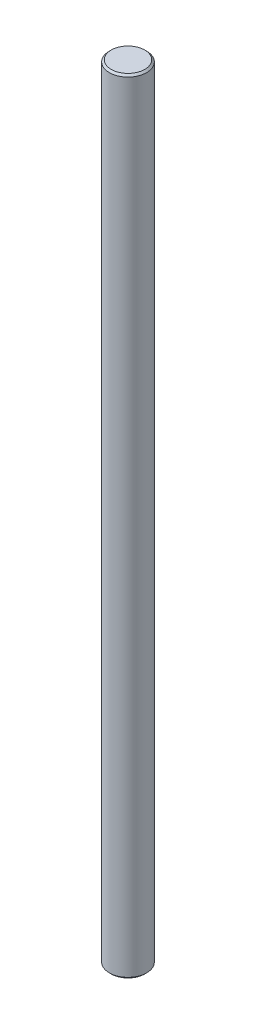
ISO-10303-21;
HEADER;
FILE_DESCRIPTION(('STEP AP214'),'2;1');
FILE_NAME('part.step','',(''),(''),'','','');
FILE_SCHEMA(('AUTOMOTIVE_DESIGN { 1 0 10303 214 1 1 1 1 }'));
ENDSEC;
DATA;
#1=APPLICATION_CONTEXT('core data for automotive mechanical design processes');
#2=APPLICATION_PROTOCOL_DEFINITION('international standard','automotive_design',2000,#1);
#3=PRODUCT_CONTEXT('',#1,'mechanical');
#4=PRODUCT('Part','Part','',(#3));
#5=PRODUCT_RELATED_PRODUCT_CATEGORY('part','',(#4));
#6=PRODUCT_DEFINITION_FORMATION('','',#4);
#7=PRODUCT_DEFINITION_CONTEXT('part definition',#1,'design');
#8=PRODUCT_DEFINITION('design','',#6,#7);
#9=PRODUCT_DEFINITION_SHAPE('','',#8);
#10=(LENGTH_UNIT() NAMED_UNIT(*) SI_UNIT(.MILLI.,.METRE.));
#11=(NAMED_UNIT(*) PLANE_ANGLE_UNIT() SI_UNIT($,.RADIAN.));
#12=(NAMED_UNIT(*) SI_UNIT($,.STERADIAN.) SOLID_ANGLE_UNIT());
#13=UNCERTAINTY_MEASURE_WITH_UNIT(LENGTH_MEASURE(1.E-05),#10,'distance_accuracy_value','');
#14=(GEOMETRIC_REPRESENTATION_CONTEXT(3) GLOBAL_UNCERTAINTY_ASSIGNED_CONTEXT((#13)) GLOBAL_UNIT_ASSIGNED_CONTEXT((#10,
#11,#12)) REPRESENTATION_CONTEXT('',''));
#15=CARTESIAN_POINT('',(0.,0.,0.));
#16=DIRECTION('',(0.,0.,1.));
#17=DIRECTION('',(1.,0.,0.));
#18=AXIS2_PLACEMENT_3D('',#15,#16,#17);
#19=CARTESIAN_POINT('',(0.,420.,0.));
#20=DIRECTION('',(0.,-1.,0.));
#21=DIRECTION('',(0.,0.,-1.));
#22=AXIS2_PLACEMENT_3D('',#19,#20,#21);
#23=CYLINDRICAL_SURFACE('',#22,10.);
#24=CARTESIAN_POINT('',(0.,0.999999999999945,0.));
#25=DIRECTION('',(0.,1.,0.));
#26=DIRECTION('',(0.,0.,1.));
#27=AXIS2_PLACEMENT_3D('',#24,#25,#26);
#28=CIRCLE('',#27,10.);
#29=CARTESIAN_POINT('',(0.,0.999999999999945,10.));
#30=VERTEX_POINT('',#29);
#31=EDGE_CURVE('E44',#30,#30,#28,.T.);
#32=ORIENTED_EDGE('',*,*,#31,.T.);
#33=EDGE_LOOP('',(#32));
#34=FACE_BOUND('',#33,.T.);
#35=CARTESIAN_POINT('',(0.,419.,0.));
#36=DIRECTION('',(0.,1.,0.));
#37=DIRECTION('',(0.,0.,1.));
#38=AXIS2_PLACEMENT_3D('',#35,#36,#37);
#39=CIRCLE('',#38,10.);
#40=CARTESIAN_POINT('',(0.,419.,10.));
#41=VERTEX_POINT('',#40);
#42=EDGE_CURVE('E48',#41,#41,#39,.F.);
#43=ORIENTED_EDGE('',*,*,#42,.T.);
#44=EDGE_LOOP('',(#43));
#45=FACE_BOUND('',#44,.T.);
#46=ADVANCED_FACE('F33',(#34,#45),#23,.T.);
#47=CARTESIAN_POINT('',(0.,420.,0.));
#48=DIRECTION('',(0.,1.,0.));
#49=DIRECTION('',(0.,0.,1.));
#50=AXIS2_PLACEMENT_3D('',#47,#48,#49);
#51=PLANE('',#50);
#52=CARTESIAN_POINT('',(0.,420.,0.));
#53=DIRECTION('',(0.,1.,0.));
#54=DIRECTION('',(0.,0.,1.));
#55=AXIS2_PLACEMENT_3D('',#52,#53,#54);
#56=CIRCLE('',#55,9.00000000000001);
#57=CARTESIAN_POINT('',(0.,420.,9.00000000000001));
#58=VERTEX_POINT('',#57);
#59=EDGE_CURVE('E10',#58,#58,#56,.T.);
#60=ORIENTED_EDGE('',*,*,#59,.T.);
#61=EDGE_LOOP('',(#60));
#62=FACE_BOUND('',#61,.T.);
#63=ADVANCED_FACE('F64',(#62),#51,.T.);
#64=CARTESIAN_POINT('',(0.,0.,0.));
#65=DIRECTION('',(0.,1.,0.));
#66=DIRECTION('',(0.,0.,1.));
#67=AXIS2_PLACEMENT_3D('',#64,#65,#66);
#68=PLANE('',#67);
#69=CARTESIAN_POINT('',(0.,0.,0.));
#70=DIRECTION('',(0.,1.,0.));
#71=DIRECTION('',(0.,0.,1.));
#72=AXIS2_PLACEMENT_3D('',#69,#70,#71);
#73=CIRCLE('',#72,9.00000000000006);
#74=CARTESIAN_POINT('',(0.,0.,9.00000000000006));
#75=VERTEX_POINT('',#74);
#76=EDGE_CURVE('E40',#75,#75,#73,.F.);
#77=ORIENTED_EDGE('',*,*,#76,.T.);
#78=EDGE_LOOP('',(#77));
#79=FACE_BOUND('',#78,.T.);
#80=ADVANCED_FACE('F61',(#79),#68,.F.);
#81=CARTESIAN_POINT('',(0.,0.999999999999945,0.));
#82=DIRECTION('',(0.,1.,0.));
#83=DIRECTION('',(0.,0.,1.));
#84=AXIS2_PLACEMENT_3D('',#81,#82,#83);
#85=CONICAL_SURFACE('',#84,10.,0.785398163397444);
#86=ORIENTED_EDGE('',*,*,#76,.F.);
#87=EDGE_LOOP('',(#86));
#88=FACE_BOUND('',#87,.T.);
#89=ORIENTED_EDGE('',*,*,#31,.F.);
#90=EDGE_LOOP('',(#89));
#91=FACE_BOUND('',#90,.T.);
#92=ADVANCED_FACE('F57',(#88,#91),#85,.T.);
#93=CARTESIAN_POINT('',(0.,420.,0.));
#94=DIRECTION('',(0.,-1.,0.));
#95=DIRECTION('',(0.,0.,-1.));
#96=AXIS2_PLACEMENT_3D('',#93,#94,#95);
#97=CONICAL_SURFACE('',#96,9.00000000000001,0.785398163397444);
#98=ORIENTED_EDGE('',*,*,#42,.F.);
#99=EDGE_LOOP('',(#98));
#100=FACE_BOUND('',#99,.T.);
#101=ORIENTED_EDGE('',*,*,#59,.F.);
#102=EDGE_LOOP('',(#101));
#103=FACE_BOUND('',#102,.T.);
#104=ADVANCED_FACE('F35',(#100,#103),#97,.T.);
#105=CLOSED_SHELL('',(#46,#63,#80,#92,#104));
#106=MANIFOLD_SOLID_BREP('B2',#105);
#107=ADVANCED_BREP_SHAPE_REPRESENTATION('',(#18,#106),#14);
#108=SHAPE_DEFINITION_REPRESENTATION(#9,#107);
ENDSEC;
END-ISO-10303-21;
